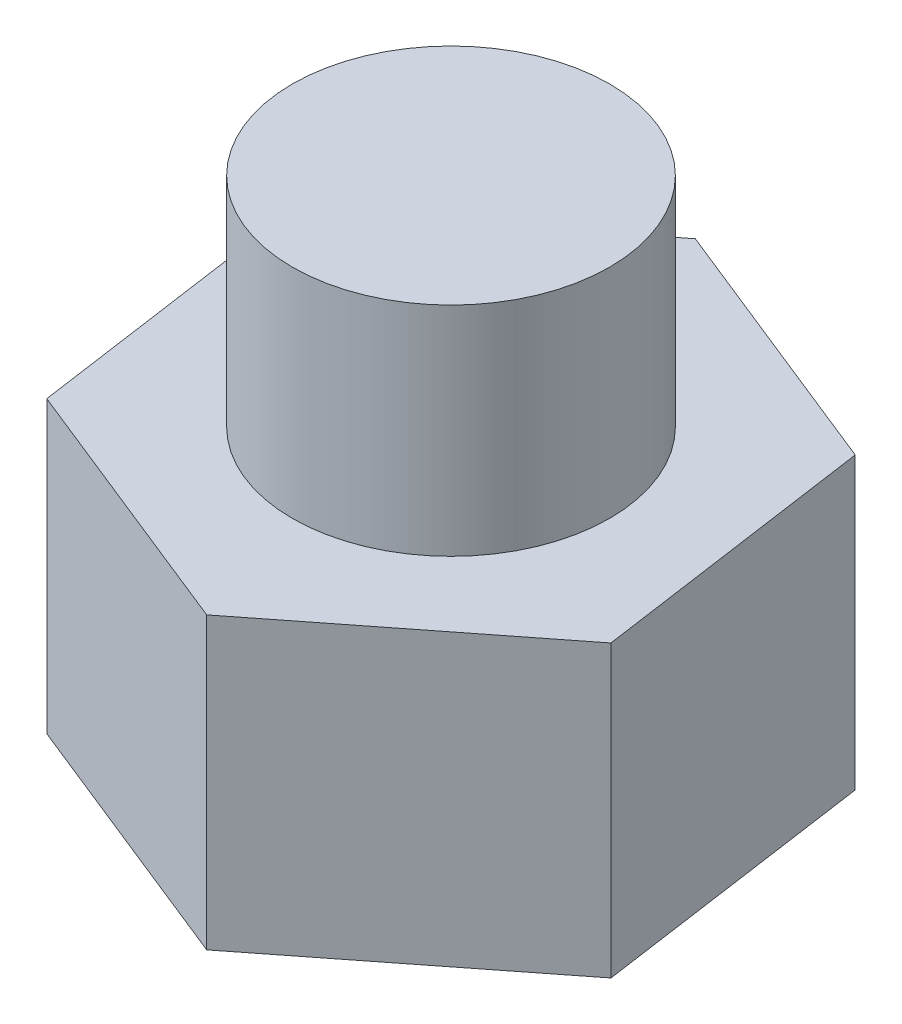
ISO-10303-21;
HEADER;
FILE_DESCRIPTION(('STEP AP214'),'2;1');
FILE_NAME('part.step','',(''),(''),'','','');
FILE_SCHEMA(('AUTOMOTIVE_DESIGN { 1 0 10303 214 1 1 1 1 }'));
ENDSEC;
DATA;
#1=APPLICATION_CONTEXT('core data for automotive mechanical design processes');
#2=APPLICATION_PROTOCOL_DEFINITION('international standard','automotive_design',2000,#1);
#3=PRODUCT_CONTEXT('',#1,'mechanical');
#4=PRODUCT('Part','Part','',(#3));
#5=PRODUCT_RELATED_PRODUCT_CATEGORY('part','',(#4));
#6=PRODUCT_DEFINITION_FORMATION('','',#4);
#7=PRODUCT_DEFINITION_CONTEXT('part definition',#1,'design');
#8=PRODUCT_DEFINITION('design','',#6,#7);
#9=PRODUCT_DEFINITION_SHAPE('','',#8);
#10=(LENGTH_UNIT() NAMED_UNIT(*) SI_UNIT(.MILLI.,.METRE.));
#11=(NAMED_UNIT(*) PLANE_ANGLE_UNIT() SI_UNIT($,.RADIAN.));
#12=(NAMED_UNIT(*) SI_UNIT($,.STERADIAN.) SOLID_ANGLE_UNIT());
#13=UNCERTAINTY_MEASURE_WITH_UNIT(LENGTH_MEASURE(1.E-05),#10,'distance_accuracy_value','');
#14=(GEOMETRIC_REPRESENTATION_CONTEXT(3) GLOBAL_UNCERTAINTY_ASSIGNED_CONTEXT((#13)) GLOBAL_UNIT_ASSIGNED_CONTEXT((#10,
#11,#12)) REPRESENTATION_CONTEXT('',''));
#15=CARTESIAN_POINT('',(0.,0.,0.));
#16=DIRECTION('',(0.,0.,1.));
#17=DIRECTION('',(1.,0.,0.));
#18=AXIS2_PLACEMENT_3D('',#15,#16,#17);
#19=CARTESIAN_POINT('',(-7.93059293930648,12.7,6.22511025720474));
#20=DIRECTION('',(0.372500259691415,0.,-0.928032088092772));
#21=DIRECTION('',(-0.928032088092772,0.,-0.372500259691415));
#22=AXIS2_PLACEMENT_3D('',#19,#20,#21);
#23=PLANE('',#22);
#24=DIRECTION('',(-0.928032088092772,0.,-0.372500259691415));
#25=VECTOR('',#24,1.);
#26=CARTESIAN_POINT('',(-7.93059293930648,2.53999999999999,6.22511025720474));
#27=LINE('',#26,#25);
#28=CARTESIAN_POINT('',(1.42580715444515,2.53999999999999,9.98065008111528));
#29=VERTEX_POINT('',#28);
#30=CARTESIAN_POINT('',(-7.93059293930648,2.53999999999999,6.22511025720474));
#31=VERTEX_POINT('',#30);
#32=EDGE_CURVE('E51',#29,#31,#27,.T.);
#33=ORIENTED_EDGE('',*,*,#32,.F.);
#34=DIRECTION('',(0.,-1.,0.));
#35=VECTOR('',#34,1.);
#36=CARTESIAN_POINT('',(1.42580715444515,12.7,9.98065008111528));
#37=LINE('',#36,#35);
#38=CARTESIAN_POINT('',(1.42580715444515,12.7,9.98065008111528));
#39=VERTEX_POINT('',#38);
#40=EDGE_CURVE('E45',#39,#29,#37,.T.);
#41=ORIENTED_EDGE('',*,*,#40,.F.);
#42=DIRECTION('',(0.928032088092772,0.,0.372500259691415));
#43=VECTOR('',#42,1.);
#44=CARTESIAN_POINT('',(-7.93059293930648,12.7,6.22511025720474));
#45=LINE('',#44,#43);
#46=CARTESIAN_POINT('',(-7.93059293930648,12.7,6.22511025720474));
#47=VERTEX_POINT('',#46);
#48=EDGE_CURVE('E127',#47,#39,#45,.T.);
#49=ORIENTED_EDGE('',*,*,#48,.F.);
#50=DIRECTION('',(0.,-1.,0.));
#51=VECTOR('',#50,1.);
#52=CARTESIAN_POINT('',(-7.93059293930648,12.7,6.22511025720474));
#53=LINE('',#52,#51);
#54=EDGE_CURVE('E106',#47,#31,#53,.T.);
#55=ORIENTED_EDGE('',*,*,#54,.T.);
#56=EDGE_LOOP('',(#33,#41,#49,#55));
#57=FACE_BOUND('',#56,.T.);
#58=ADVANCED_FACE('F38',(#57),#23,.F.);
#59=CARTESIAN_POINT('',(1.42580715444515,12.7,9.98065008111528));
#60=DIRECTION('',(-0.617449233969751,0.,-0.786610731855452));
#61=DIRECTION('',(-0.786610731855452,0.,0.617449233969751));
#62=AXIS2_PLACEMENT_3D('',#59,#60,#61);
#63=PLANE('',#62);
#64=DIRECTION('',(-0.786610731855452,0.,0.617449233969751));
#65=VECTOR('',#64,1.);
#66=CARTESIAN_POINT('',(1.42580715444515,2.53999999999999,9.98065008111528));
#67=LINE('',#66,#65);
#68=CARTESIAN_POINT('',(9.35640009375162,2.53999999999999,3.75553982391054));
#69=VERTEX_POINT('',#68);
#70=EDGE_CURVE('E123',#69,#29,#67,.T.);
#71=ORIENTED_EDGE('',*,*,#70,.F.);
#72=DIRECTION('',(0.,-1.,0.));
#73=VECTOR('',#72,1.);
#74=CARTESIAN_POINT('',(9.35640009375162,12.7,3.75553982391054));
#75=LINE('',#74,#73);
#76=CARTESIAN_POINT('',(9.35640009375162,12.7,3.75553982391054));
#77=VERTEX_POINT('',#76);
#78=EDGE_CURVE('E115',#77,#69,#75,.T.);
#79=ORIENTED_EDGE('',*,*,#78,.F.);
#80=DIRECTION('',(0.786610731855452,0.,-0.617449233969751));
#81=VECTOR('',#80,1.);
#82=CARTESIAN_POINT('',(1.42580715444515,12.7,9.98065008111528));
#83=LINE('',#82,#81);
#84=EDGE_CURVE('E124',#39,#77,#83,.T.);
#85=ORIENTED_EDGE('',*,*,#84,.F.);
#86=ORIENTED_EDGE('',*,*,#40,.T.);
#87=EDGE_LOOP('',(#71,#79,#85,#86));
#88=FACE_BOUND('',#87,.T.);
#89=ADVANCED_FACE('F121',(#88),#63,.F.);
#90=CARTESIAN_POINT('',(9.35640009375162,12.7,3.75553982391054));
#91=DIRECTION('',(-0.989949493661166,0.,0.14142135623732));
#92=DIRECTION('',(0.14142135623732,0.,0.989949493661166));
#93=AXIS2_PLACEMENT_3D('',#90,#91,#92);
#94=PLANE('',#93);
#95=DIRECTION('',(0.14142135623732,0.,0.989949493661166));
#96=VECTOR('',#95,1.);
#97=CARTESIAN_POINT('',(9.35640009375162,2.53999999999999,3.75553982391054));
#98=LINE('',#97,#96);
#99=CARTESIAN_POINT('',(7.93059293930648,2.53999999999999,-6.22511025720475));
#100=VERTEX_POINT('',#99);
#101=EDGE_CURVE('E133',#100,#69,#98,.T.);
#102=ORIENTED_EDGE('',*,*,#101,.F.);
#103=DIRECTION('',(0.,-1.,0.));
#104=VECTOR('',#103,1.);
#105=CARTESIAN_POINT('',(7.93059293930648,12.7,-6.22511025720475));
#106=LINE('',#105,#104);
#107=CARTESIAN_POINT('',(7.93059293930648,12.7,-6.22511025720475));
#108=VERTEX_POINT('',#107);
#109=EDGE_CURVE('E108',#108,#100,#106,.T.);
#110=ORIENTED_EDGE('',*,*,#109,.F.);
#111=DIRECTION('',(-0.14142135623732,0.,-0.989949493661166));
#112=VECTOR('',#111,1.);
#113=CARTESIAN_POINT('',(9.35640009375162,12.7,3.75553982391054));
#114=LINE('',#113,#112);
#115=EDGE_CURVE('E141',#77,#108,#114,.T.);
#116=ORIENTED_EDGE('',*,*,#115,.F.);
#117=ORIENTED_EDGE('',*,*,#78,.T.);
#118=EDGE_LOOP('',(#102,#110,#116,#117));
#119=FACE_BOUND('',#118,.T.);
#120=ADVANCED_FACE('F180',(#119),#94,.F.);
#121=CARTESIAN_POINT('',(7.93059293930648,12.7,-6.22511025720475));
#122=DIRECTION('',(-0.372500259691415,0.,0.928032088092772));
#123=DIRECTION('',(0.928032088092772,0.,0.372500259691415));
#124=AXIS2_PLACEMENT_3D('',#121,#122,#123);
#125=PLANE('',#124);
#126=DIRECTION('',(0.928032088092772,0.,0.372500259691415));
#127=VECTOR('',#126,1.);
#128=CARTESIAN_POINT('',(7.93059293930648,2.53999999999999,-6.22511025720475));
#129=LINE('',#128,#127);
#130=CARTESIAN_POINT('',(-1.42580715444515,2.53999999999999,-9.98065008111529));
#131=VERTEX_POINT('',#130);
#132=EDGE_CURVE('E102',#131,#100,#129,.T.);
#133=ORIENTED_EDGE('',*,*,#132,.F.);
#134=DIRECTION('',(0.,-1.,0.));
#135=VECTOR('',#134,1.);
#136=CARTESIAN_POINT('',(-1.42580715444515,12.7,-9.98065008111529));
#137=LINE('',#136,#135);
#138=CARTESIAN_POINT('',(-1.42580715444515,12.7,-9.98065008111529));
#139=VERTEX_POINT('',#138);
#140=EDGE_CURVE('E101',#139,#131,#137,.T.);
#141=ORIENTED_EDGE('',*,*,#140,.F.);
#142=DIRECTION('',(-0.928032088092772,0.,-0.372500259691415));
#143=VECTOR('',#142,1.);
#144=CARTESIAN_POINT('',(7.93059293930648,12.7,-6.22511025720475));
#145=LINE('',#144,#143);
#146=EDGE_CURVE('E143',#108,#139,#145,.T.);
#147=ORIENTED_EDGE('',*,*,#146,.F.);
#148=ORIENTED_EDGE('',*,*,#109,.T.);
#149=EDGE_LOOP('',(#133,#141,#147,#148));
#150=FACE_BOUND('',#149,.T.);
#151=ADVANCED_FACE('F152',(#150),#125,.F.);
#152=CARTESIAN_POINT('',(-1.42580715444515,12.7,-9.98065008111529));
#153=DIRECTION('',(0.617449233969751,0.,0.786610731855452));
#154=DIRECTION('',(0.786610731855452,0.,-0.617449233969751));
#155=AXIS2_PLACEMENT_3D('',#152,#153,#154);
#156=PLANE('',#155);
#157=DIRECTION('',(0.786610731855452,0.,-0.617449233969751));
#158=VECTOR('',#157,1.);
#159=CARTESIAN_POINT('',(-1.42580715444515,2.53999999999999,-9.98065008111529));
#160=LINE('',#159,#158);
#161=CARTESIAN_POINT('',(-9.35640009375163,2.53999999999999,-3.75553982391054));
#162=VERTEX_POINT('',#161);
#163=EDGE_CURVE('E89',#162,#131,#160,.T.);
#164=ORIENTED_EDGE('',*,*,#163,.F.);
#165=DIRECTION('',(0.,-1.,0.));
#166=VECTOR('',#165,1.);
#167=CARTESIAN_POINT('',(-9.35640009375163,12.7,-3.75553982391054));
#168=LINE('',#167,#166);
#169=CARTESIAN_POINT('',(-9.35640009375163,12.7,-3.75553982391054));
#170=VERTEX_POINT('',#169);
#171=EDGE_CURVE('E99',#170,#162,#168,.T.);
#172=ORIENTED_EDGE('',*,*,#171,.F.);
#173=DIRECTION('',(-0.786610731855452,0.,0.617449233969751));
#174=VECTOR('',#173,1.);
#175=CARTESIAN_POINT('',(-1.42580715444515,12.7,-9.98065008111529));
#176=LINE('',#175,#174);
#177=EDGE_CURVE('E145',#139,#170,#176,.T.);
#178=ORIENTED_EDGE('',*,*,#177,.F.);
#179=ORIENTED_EDGE('',*,*,#140,.T.);
#180=EDGE_LOOP('',(#164,#172,#178,#179));
#181=FACE_BOUND('',#180,.T.);
#182=ADVANCED_FACE('F97',(#181),#156,.F.);
#183=CARTESIAN_POINT('',(-9.35640009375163,12.7,-3.75553982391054));
#184=DIRECTION('',(0.989949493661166,0.,-0.14142135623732));
#185=DIRECTION('',(-0.14142135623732,0.,-0.989949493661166));
#186=AXIS2_PLACEMENT_3D('',#183,#184,#185);
#187=PLANE('',#186);
#188=DIRECTION('',(-0.14142135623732,0.,-0.989949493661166));
#189=VECTOR('',#188,1.);
#190=CARTESIAN_POINT('',(-9.35640009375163,2.53999999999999,-3.75553982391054));
#191=LINE('',#190,#189);
#192=EDGE_CURVE('E11',#31,#162,#191,.T.);
#193=ORIENTED_EDGE('',*,*,#192,.F.);
#194=ORIENTED_EDGE('',*,*,#54,.F.);
#195=DIRECTION('',(0.14142135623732,0.,0.989949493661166));
#196=VECTOR('',#195,1.);
#197=CARTESIAN_POINT('',(-9.35640009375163,12.7,-3.75553982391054));
#198=LINE('',#197,#196);
#199=EDGE_CURVE('E59',#170,#47,#198,.T.);
#200=ORIENTED_EDGE('',*,*,#199,.F.);
#201=ORIENTED_EDGE('',*,*,#171,.T.);
#202=EDGE_LOOP('',(#193,#194,#200,#201));
#203=FACE_BOUND('',#202,.T.);
#204=ADVANCED_FACE('F105',(#203),#187,.F.);
#205=CARTESIAN_POINT('',(1.42580715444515,12.7,9.98065008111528));
#206=DIRECTION('',(0.,1.,0.));
#207=DIRECTION('',(0.,0.,1.));
#208=AXIS2_PLACEMENT_3D('',#205,#206,#207);
#209=PLANE('',#208);
#210=ORIENTED_EDGE('',*,*,#48,.T.);
#211=ORIENTED_EDGE('',*,*,#84,.T.);
#212=ORIENTED_EDGE('',*,*,#115,.T.);
#213=ORIENTED_EDGE('',*,*,#146,.T.);
#214=ORIENTED_EDGE('',*,*,#177,.T.);
#215=ORIENTED_EDGE('',*,*,#199,.T.);
#216=EDGE_LOOP('',(#210,#211,#212,#213,#214,#215));
#217=FACE_BOUND('',#216,.T.);
#218=CARTESIAN_POINT('',(0.,12.7,0.));
#219=DIRECTION('',(0.,1.,0.));
#220=DIRECTION('',(0.,0.,1.));
#221=AXIS2_PLACEMENT_3D('',#218,#219,#220);
#222=CIRCLE('',#221,5.55625);
#223=CARTESIAN_POINT('',(0.,12.7,-5.55625));
#224=VERTEX_POINT('',#223);
#225=EDGE_CURVE('E128',#224,#224,#222,.T.);
#226=ORIENTED_EDGE('',*,*,#225,.F.);
#227=EDGE_LOOP('',(#226));
#228=FACE_BOUND('',#227,.T.);
#229=ADVANCED_FACE('F146',(#217,#228),#209,.T.);
#230=CARTESIAN_POINT('',(0.,20.32,0.));
#231=DIRECTION('',(0.,-1.,0.));
#232=DIRECTION('',(0.,0.,-1.));
#233=AXIS2_PLACEMENT_3D('',#230,#231,#232);
#234=CYLINDRICAL_SURFACE('',#233,5.55625);
#235=CARTESIAN_POINT('',(0.,20.32,0.));
#236=DIRECTION('',(0.,1.,0.));
#237=DIRECTION('',(0.,0.,1.));
#238=AXIS2_PLACEMENT_3D('',#235,#236,#237);
#239=CIRCLE('',#238,5.55625);
#240=CARTESIAN_POINT('',(0.,20.32,-5.55625));
#241=VERTEX_POINT('',#240);
#242=EDGE_CURVE('E131',#241,#241,#239,.T.);
#243=CARTESIAN_POINT('',(0.,20.32,-5.55625));
#244=CARTESIAN_POINT('',(0.,20.240625,-5.55625));
#245=CARTESIAN_POINT('',(0.,20.16125,-5.55625));
#246=CARTESIAN_POINT('',(0.,20.0025,-5.55625));
#247=CARTESIAN_POINT('',(0.,19.923125,-5.55625));
#248=CARTESIAN_POINT('',(0.,19.764375,-5.55625));
#249=CARTESIAN_POINT('',(0.,19.685,-5.55625));
#250=CARTESIAN_POINT('',(0.,19.52625,-5.55625));
#251=CARTESIAN_POINT('',(0.,19.446875,-5.55625));
#252=CARTESIAN_POINT('',(0.,19.288125,-5.55625));
#253=CARTESIAN_POINT('',(0.,19.20875,-5.55625));
#254=CARTESIAN_POINT('',(0.,19.05,-5.55625));
#255=CARTESIAN_POINT('',(0.,18.970625,-5.55625));
#256=CARTESIAN_POINT('',(0.,18.811875,-5.55625));
#257=CARTESIAN_POINT('',(0.,18.7325,-5.55625));
#258=CARTESIAN_POINT('',(0.,18.57375,-5.55625));
#259=CARTESIAN_POINT('',(0.,18.494375,-5.55625));
#260=CARTESIAN_POINT('',(0.,18.335625,-5.55625));
#261=CARTESIAN_POINT('',(0.,18.25625,-5.55625));
#262=CARTESIAN_POINT('',(0.,18.0975,-5.55625));
#263=CARTESIAN_POINT('',(0.,18.018125,-5.55625));
#264=CARTESIAN_POINT('',(0.,17.859375,-5.55625));
#265=CARTESIAN_POINT('',(0.,17.78,-5.55625));
#266=CARTESIAN_POINT('',(0.,17.62125,-5.55625));
#267=CARTESIAN_POINT('',(0.,17.541875,-5.55625));
#268=CARTESIAN_POINT('',(0.,17.383125,-5.55625));
#269=CARTESIAN_POINT('',(0.,17.30375,-5.55625));
#270=CARTESIAN_POINT('',(0.,17.145,-5.55625));
#271=CARTESIAN_POINT('',(0.,17.065625,-5.55625));
#272=CARTESIAN_POINT('',(0.,16.906875,-5.55625));
#273=CARTESIAN_POINT('',(0.,16.8275,-5.55625));
#274=CARTESIAN_POINT('',(0.,16.66875,-5.55625));
#275=CARTESIAN_POINT('',(0.,16.589375,-5.55625));
#276=CARTESIAN_POINT('',(0.,16.430625,-5.55625));
#277=CARTESIAN_POINT('',(0.,16.35125,-5.55625));
#278=CARTESIAN_POINT('',(0.,16.1925,-5.55625));
#279=CARTESIAN_POINT('',(0.,16.113125,-5.55625));
#280=CARTESIAN_POINT('',(0.,15.954375,-5.55625));
#281=CARTESIAN_POINT('',(0.,15.875,-5.55625));
#282=CARTESIAN_POINT('',(0.,15.71625,-5.55625));
#283=CARTESIAN_POINT('',(0.,15.636875,-5.55625));
#284=CARTESIAN_POINT('',(0.,15.478125,-5.55625));
#285=CARTESIAN_POINT('',(0.,15.39875,-5.55625));
#286=CARTESIAN_POINT('',(0.,15.24,-5.55625));
#287=CARTESIAN_POINT('',(0.,15.160625,-5.55625));
#288=CARTESIAN_POINT('',(0.,15.001875,-5.55625));
#289=CARTESIAN_POINT('',(0.,14.9225,-5.55625));
#290=CARTESIAN_POINT('',(0.,14.76375,-5.55625));
#291=CARTESIAN_POINT('',(0.,14.684375,-5.55625));
#292=CARTESIAN_POINT('',(0.,14.525625,-5.55625));
#293=CARTESIAN_POINT('',(0.,14.44625,-5.55625));
#294=CARTESIAN_POINT('',(0.,14.2875,-5.55625));
#295=CARTESIAN_POINT('',(0.,14.208125,-5.55625));
#296=CARTESIAN_POINT('',(0.,14.049375,-5.55625));
#297=CARTESIAN_POINT('',(0.,13.97,-5.55625));
#298=CARTESIAN_POINT('',(0.,13.81125,-5.55625));
#299=CARTESIAN_POINT('',(0.,13.731875,-5.55625));
#300=CARTESIAN_POINT('',(0.,13.573125,-5.55625));
#301=CARTESIAN_POINT('',(0.,13.49375,-5.55625));
#302=CARTESIAN_POINT('',(0.,13.335,-5.55625));
#303=CARTESIAN_POINT('',(0.,13.255625,-5.55625));
#304=CARTESIAN_POINT('',(0.,13.096875,-5.55625));
#305=CARTESIAN_POINT('',(0.,13.0175,-5.55625));
#306=CARTESIAN_POINT('',(0.,12.85875,-5.55625));
#307=CARTESIAN_POINT('',(0.,12.779375,-5.55625));
#308=CARTESIAN_POINT('',(0.,12.7,-5.55625));
#309=B_SPLINE_CURVE_WITH_KNOTS('',3,(#243,#244,#245,#246,#247,#248,#249,#250,#251,#252,#253,
#254,#255,#256,#257,#258,#259,#260,#261,#262,#263,#264,#265,#266,#267,#268,#269,#270,#271,#272,
#273,#274,#275,#276,#277,#278,#279,#280,#281,#282,#283,#284,#285,#286,#287,#288,#289,#290,#291,
#292,#293,#294,#295,#296,#297,#298,#299,#300,#301,#302,#303,#304,#305,#306,#307,#308),
.UNSPECIFIED.,.F.,.F.,(4,2,2,2,2,2,2,2,2,2,2,2,2,2,2,2,2,2,2,2,2,2,2,2,2,2,2,2,2,2,2,2,4),(0.,
0.238124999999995,0.476249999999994,0.714374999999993,0.952499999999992,1.19062499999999,
1.42874999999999,1.66687499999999,1.90499999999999,2.14312499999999,2.38124999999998,
2.61937499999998,2.85749999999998,3.09562499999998,3.33374999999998,3.57187499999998,
3.80999999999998,4.04812499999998,4.28624999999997,4.52437499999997,4.76249999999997,
5.00062499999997,5.23874999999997,5.47687499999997,5.71499999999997,5.95312499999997,
6.19124999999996,6.42937499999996,6.66749999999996,6.90562499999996,7.14374999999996,
7.38187499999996,7.61999999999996),.UNSPECIFIED.);
#310=EDGE_CURVE('BSEAM194',#241,#224,#309,.T.);
#311=ORIENTED_EDGE('',*,*,#242,.F.);
#312=ORIENTED_EDGE('',*,*,#225,.T.);
#313=ORIENTED_EDGE('',*,*,#310,.T.);
#314=ORIENTED_EDGE('',*,*,#310,.F.);
#315=EDGE_LOOP('',(#311,#313,#312,#314));
#316=FACE_BOUND('',#315,.T.);
#317=ADVANCED_FACE('F194',(#316),#234,.T.);
#318=CARTESIAN_POINT('',(0.,20.32,0.));
#319=DIRECTION('',(0.,1.,0.));
#320=DIRECTION('',(0.,0.,1.));
#321=AXIS2_PLACEMENT_3D('',#318,#319,#320);
#322=PLANE('',#321);
#323=ORIENTED_EDGE('',*,*,#242,.T.);
#324=EDGE_LOOP('',(#323));
#325=FACE_BOUND('',#324,.T.);
#326=ADVANCED_FACE('F173',(#325),#322,.T.);
#327=CARTESIAN_POINT('',(0.,2.53999999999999,0.));
#328=DIRECTION('',(0.,-1.,0.));
#329=DIRECTION('',(0.,0.,-1.));
#330=AXIS2_PLACEMENT_3D('',#327,#328,#329);
#331=PLANE('',#330);
#332=CARTESIAN_POINT('',(0.,2.53999999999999,0.));
#333=DIRECTION('',(0.,-1.,0.));
#334=DIRECTION('',(0.,0.,-1.));
#335=AXIS2_PLACEMENT_3D('',#332,#333,#334);
#336=CIRCLE('',#335,5.08);
#337=CARTESIAN_POINT('',(0.,2.53999999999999,-5.08));
#338=VERTEX_POINT('',#337);
#339=EDGE_CURVE('E103',#338,#338,#336,.T.);
#340=ORIENTED_EDGE('',*,*,#339,.F.);
#341=EDGE_LOOP('',(#340));
#342=FACE_BOUND('',#341,.T.);
#343=ORIENTED_EDGE('',*,*,#32,.T.);
#344=ORIENTED_EDGE('',*,*,#192,.T.);
#345=ORIENTED_EDGE('',*,*,#163,.T.);
#346=ORIENTED_EDGE('',*,*,#132,.T.);
#347=ORIENTED_EDGE('',*,*,#101,.T.);
#348=ORIENTED_EDGE('',*,*,#70,.T.);
#349=EDGE_LOOP('',(#343,#344,#345,#346,#347,#348));
#350=FACE_BOUND('',#349,.T.);
#351=ADVANCED_FACE('F88',(#342,#350),#331,.T.);
#352=CARTESIAN_POINT('',(0.,2.53999999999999,0.));
#353=DIRECTION('',(0.,-1.,0.));
#354=DIRECTION('',(0.,0.,-1.));
#355=AXIS2_PLACEMENT_3D('',#352,#353,#354);
#356=CYLINDRICAL_SURFACE('',#355,5.08);
#357=ORIENTED_EDGE('',*,*,#339,.T.);
#358=EDGE_LOOP('',(#357));
#359=FACE_BOUND('',#358,.T.);
#360=CARTESIAN_POINT('',(0.,0.,0.));
#361=DIRECTION('',(0.,-1.,0.));
#362=DIRECTION('',(0.,0.,-1.));
#363=AXIS2_PLACEMENT_3D('',#360,#361,#362);
#364=CIRCLE('',#363,5.08);
#365=CARTESIAN_POINT('',(0.,0.,-5.08));
#366=VERTEX_POINT('',#365);
#367=EDGE_CURVE('E158',#366,#366,#364,.T.);
#368=ORIENTED_EDGE('',*,*,#367,.F.);
#369=EDGE_LOOP('',(#368));
#370=FACE_BOUND('',#369,.T.);
#371=ADVANCED_FACE('F164',(#359,#370),#356,.T.);
#372=CARTESIAN_POINT('',(1.42580715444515,0.,9.98065008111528));
#373=DIRECTION('',(0.,1.,0.));
#374=DIRECTION('',(0.,0.,1.));
#375=AXIS2_PLACEMENT_3D('',#372,#373,#374);
#376=PLANE('',#375);
#377=ORIENTED_EDGE('',*,*,#367,.T.);
#378=EDGE_LOOP('',(#377));
#379=FACE_BOUND('',#378,.T.);
#380=ADVANCED_FACE('F162',(#379),#376,.F.);
#381=CLOSED_SHELL('',(#58,#89,#120,#151,#182,#204,#229,#317,#326,#351,#371,#380));
#382=MANIFOLD_SOLID_BREP('B2',#381);
#383=ADVANCED_BREP_SHAPE_REPRESENTATION('',(#18,#382),#14);
#384=SHAPE_DEFINITION_REPRESENTATION(#9,#383);
ENDSEC;
END-ISO-10303-21;
